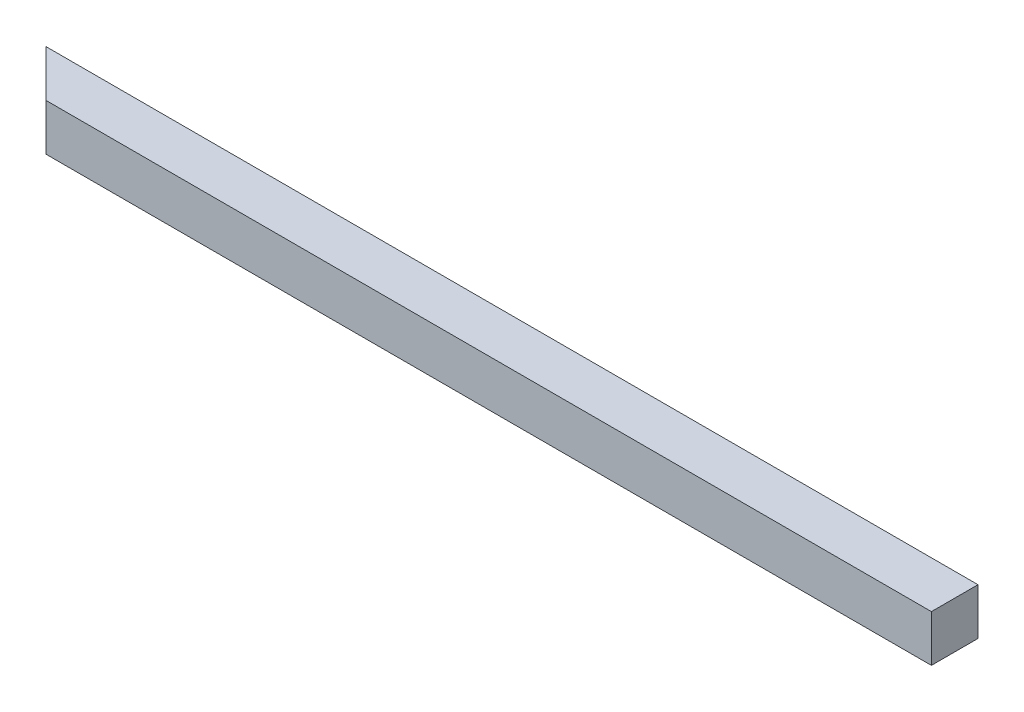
from build123d import *

# Parameters (mm, degrees)
BOSS_EXTRUDE1_DEPTH = 20


with BuildPart() as part:
    # Sketch1 → Boss-Extrude1 (new body)
    with BuildSketch(Plane(origin=(0, 0, 0), x_dir=(1, 0, 0), z_dir=(0, 1, 0))):
        Polygon((-200, 10), (-180, -10), (200, -10), (200, 10), align=None)
    extrude(amount=BOSS_EXTRUDE1_DEPTH)


solid = part.part
